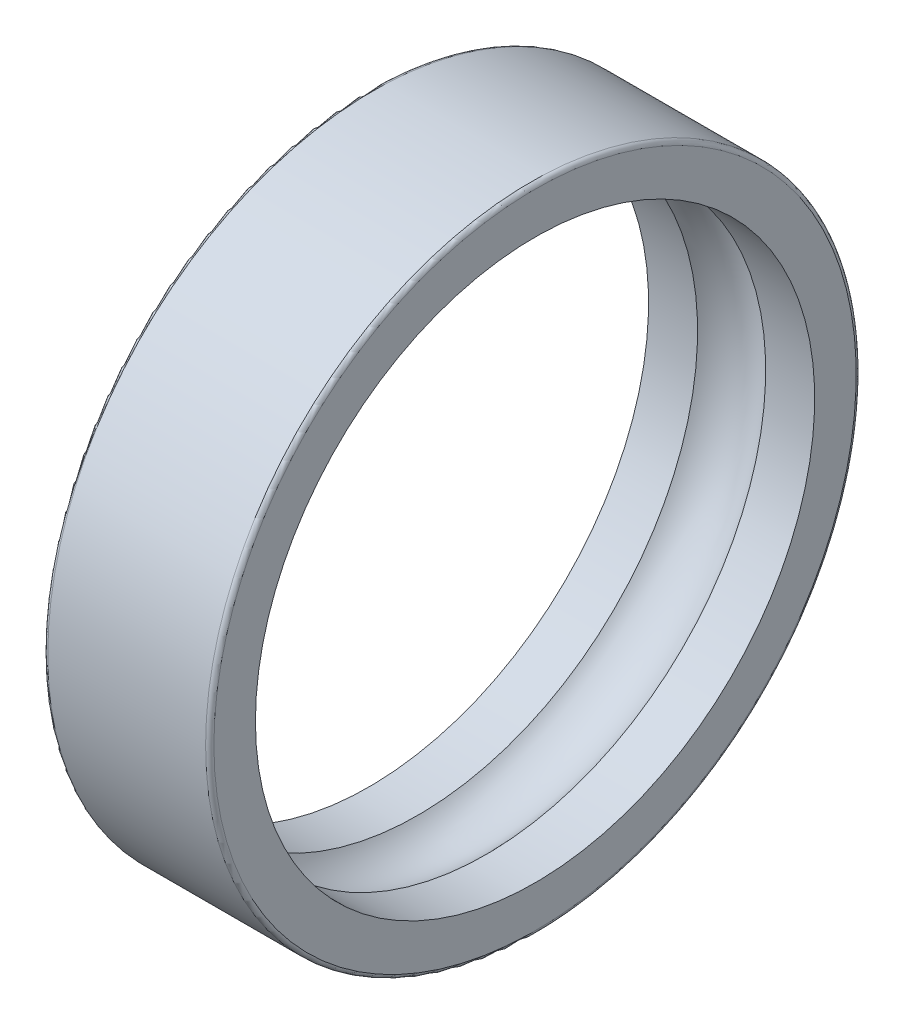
from build123d import *


with BuildPart() as part:
    # Esquisse1 → Base-R_volution (revolve)
    with BuildSketch(Plane(origin=(0, 0, 0), x_dir=(1, 0, 0), z_dir=(0, 1, 0)), mode=Mode.PRIVATE) as base_r_volution_sk:
        with BuildLine():
            Line((0, 23.2), (0, 20.2))
            Line((0, 20.2), (3.540325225, 20.2))
            ThreePointArc((3.540325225, 20.2), (6, 21.3), (8.459674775, 20.2))
            Line((8.459674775, 20.2), (12, 20.2))
            Line((12, 20.2), (12, 23.2))
            ThreePointArc((12, 23.2), (11.912132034, 23.412132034), (11.7, 23.5))
            Line((11.7, 23.5), (0.3, 23.5))
            ThreePointArc((0.3, 23.5), (0.087867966, 23.412132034), (0, 23.2))
        make_face()
    revolve(base_r_volution_sk.sketch.rotate(Axis((0, 0, 0), (1, 0, 0)), 180), axis=Axis((0, 0, 0), (1, 0, 0)))


solid = part.part
